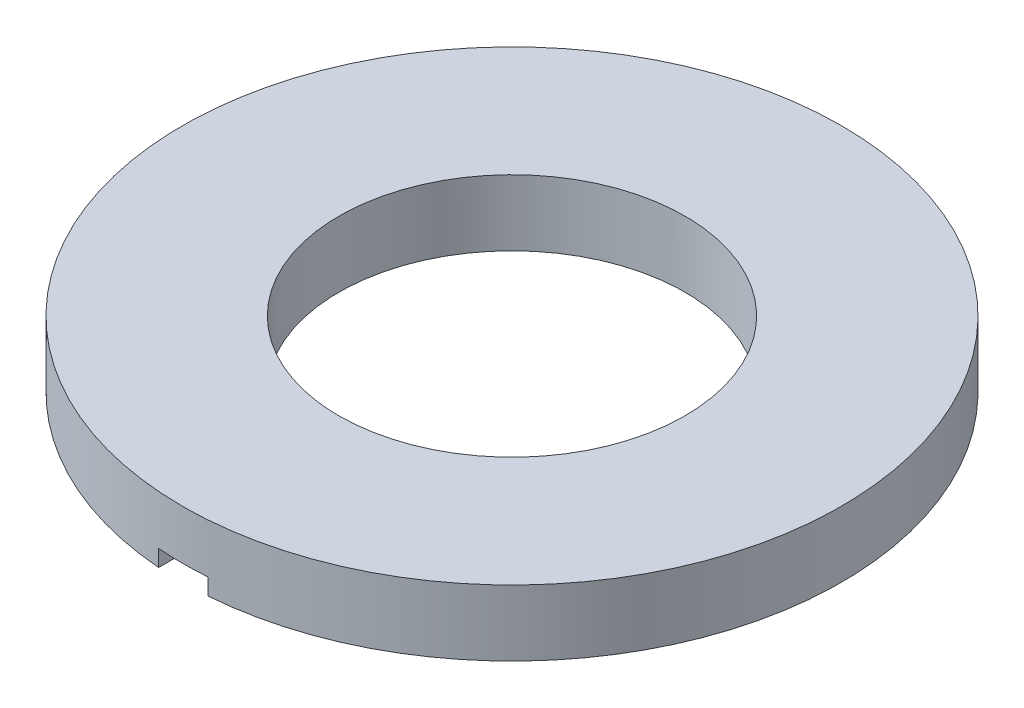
ISO-10303-21;
HEADER;
FILE_DESCRIPTION(('STEP AP214'),'2;1');
FILE_NAME('part.step','',(''),(''),'','','');
FILE_SCHEMA(('AUTOMOTIVE_DESIGN { 1 0 10303 214 1 1 1 1 }'));
ENDSEC;
DATA;
#1=APPLICATION_CONTEXT('core data for automotive mechanical design processes');
#2=APPLICATION_PROTOCOL_DEFINITION('international standard','automotive_design',2000,#1);
#3=PRODUCT_CONTEXT('',#1,'mechanical');
#4=PRODUCT('Part','Part','',(#3));
#5=PRODUCT_RELATED_PRODUCT_CATEGORY('part','',(#4));
#6=PRODUCT_DEFINITION_FORMATION('','',#4);
#7=PRODUCT_DEFINITION_CONTEXT('part definition',#1,'design');
#8=PRODUCT_DEFINITION('design','',#6,#7);
#9=PRODUCT_DEFINITION_SHAPE('','',#8);
#10=(LENGTH_UNIT() NAMED_UNIT(*) SI_UNIT(.MILLI.,.METRE.));
#11=(NAMED_UNIT(*) PLANE_ANGLE_UNIT() SI_UNIT($,.RADIAN.));
#12=(NAMED_UNIT(*) SI_UNIT($,.STERADIAN.) SOLID_ANGLE_UNIT());
#13=UNCERTAINTY_MEASURE_WITH_UNIT(LENGTH_MEASURE(1.E-05),#10,'distance_accuracy_value','');
#14=(GEOMETRIC_REPRESENTATION_CONTEXT(3) GLOBAL_UNCERTAINTY_ASSIGNED_CONTEXT((#13)) GLOBAL_UNIT_ASSIGNED_CONTEXT((#10,
#11,#12)) REPRESENTATION_CONTEXT('',''));
#15=CARTESIAN_POINT('',(0.,0.,0.));
#16=DIRECTION('',(0.,0.,1.));
#17=DIRECTION('',(1.,0.,0.));
#18=AXIS2_PLACEMENT_3D('',#15,#16,#17);
#19=CARTESIAN_POINT('',(0.,2.,0.));
#20=DIRECTION('',(0.,1.,0.));
#21=DIRECTION('',(0.,0.,1.));
#22=AXIS2_PLACEMENT_3D('',#19,#20,#21);
#23=PLANE('',#22);
#24=CARTESIAN_POINT('',(0.,2.,0.));
#25=DIRECTION('',(0.,1.,0.));
#26=DIRECTION('',(0.,0.,1.));
#27=AXIS2_PLACEMENT_3D('',#24,#25,#26);
#28=CIRCLE('',#27,10.);
#29=CARTESIAN_POINT('',(0.,2.,10.));
#30=VERTEX_POINT('',#29);
#31=EDGE_CURVE('E114',#30,#30,#28,.T.);
#32=ORIENTED_EDGE('',*,*,#31,.T.);
#33=EDGE_LOOP('',(#32));
#34=FACE_BOUND('',#33,.T.);
#35=CARTESIAN_POINT('',(0.,2.,0.));
#36=DIRECTION('',(0.,1.,0.));
#37=DIRECTION('',(0.,0.,1.));
#38=AXIS2_PLACEMENT_3D('',#35,#36,#37);
#39=CIRCLE('',#38,5.25);
#40=CARTESIAN_POINT('',(0.,2.,5.25));
#41=VERTEX_POINT('',#40);
#42=EDGE_CURVE('E102',#41,#41,#39,.T.);
#43=ORIENTED_EDGE('',*,*,#42,.F.);
#44=EDGE_LOOP('',(#43));
#45=FACE_BOUND('',#44,.T.);
#46=ADVANCED_FACE('F39',(#34,#45),#23,.T.);
#47=CARTESIAN_POINT('',(0.,0.,0.));
#48=DIRECTION('',(0.,1.,0.));
#49=DIRECTION('',(0.,0.,1.));
#50=AXIS2_PLACEMENT_3D('',#47,#48,#49);
#51=PLANE('',#50);
#52=CARTESIAN_POINT('',(0.,0.,0.));
#53=DIRECTION('',(0.,1.,0.));
#54=DIRECTION('',(0.,0.,1.));
#55=AXIS2_PLACEMENT_3D('',#52,#53,#54);
#56=CIRCLE('',#55,10.);
#57=CARTESIAN_POINT('',(0.75,0.,9.97183533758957));
#58=VERTEX_POINT('',#57);
#59=CARTESIAN_POINT('',(-0.75,0.,9.97183533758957));
#60=VERTEX_POINT('',#59);
#61=EDGE_CURVE('E94',#58,#60,#56,.T.);
#62=ORIENTED_EDGE('',*,*,#61,.F.);
#63=DIRECTION('',(0.,0.,1.));
#64=VECTOR('',#63,1.);
#65=CARTESIAN_POINT('',(0.75,0.,0.500000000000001));
#66=LINE('',#65,#64);
#67=CARTESIAN_POINT('',(0.75,0.,5.19615242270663));
#68=VERTEX_POINT('',#67);
#69=EDGE_CURVE('E81',#68,#58,#66,.T.);
#70=ORIENTED_EDGE('',*,*,#69,.F.);
#71=CARTESIAN_POINT('',(0.,0.,0.));
#72=DIRECTION('',(0.,1.,0.));
#73=DIRECTION('',(0.,0.,1.));
#74=AXIS2_PLACEMENT_3D('',#71,#72,#73);
#75=CIRCLE('',#74,5.25);
#76=CARTESIAN_POINT('',(-0.75,0.,5.19615242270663));
#77=VERTEX_POINT('',#76);
#78=EDGE_CURVE('E92',#68,#77,#75,.T.);
#79=ORIENTED_EDGE('',*,*,#78,.T.);
#80=DIRECTION('',(0.,0.,-1.));
#81=VECTOR('',#80,1.);
#82=CARTESIAN_POINT('',(-0.75,0.,0.500000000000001));
#83=LINE('',#82,#81);
#84=EDGE_CURVE('E96',#60,#77,#83,.T.);
#85=ORIENTED_EDGE('',*,*,#84,.F.);
#86=EDGE_LOOP('',(#62,#70,#79,#85));
#87=FACE_BOUND('',#86,.T.);
#88=ADVANCED_FACE('F90',(#87),#51,.F.);
#89=CARTESIAN_POINT('',(0.,2.,0.));
#90=DIRECTION('',(0.,-1.,0.));
#91=DIRECTION('',(0.,0.,-1.));
#92=AXIS2_PLACEMENT_3D('',#89,#90,#91);
#93=CYLINDRICAL_SURFACE('',#92,10.);
#94=ORIENTED_EDGE('',*,*,#31,.F.);
#95=EDGE_LOOP('',(#94));
#96=FACE_BOUND('',#95,.T.);
#97=CARTESIAN_POINT('',(0.,0.5,0.));
#98=DIRECTION('',(0.,1.,0.));
#99=DIRECTION('',(0.,0.,1.));
#100=AXIS2_PLACEMENT_3D('',#97,#98,#99);
#101=CIRCLE('',#100,10.);
#102=CARTESIAN_POINT('',(-0.75,0.5,9.97183533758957));
#103=VERTEX_POINT('',#102);
#104=CARTESIAN_POINT('',(0.75,0.5,9.97183533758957));
#105=VERTEX_POINT('',#104);
#106=EDGE_CURVE('E60',#103,#105,#101,.T.);
#107=ORIENTED_EDGE('',*,*,#106,.T.);
#108=DIRECTION('',(0.,-1.,0.));
#109=VECTOR('',#108,1.);
#110=CARTESIAN_POINT('',(0.75,2.,9.97183533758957));
#111=LINE('',#110,#109);
#112=EDGE_CURVE('E103',#105,#58,#111,.T.);
#113=ORIENTED_EDGE('',*,*,#112,.T.);
#114=ORIENTED_EDGE('',*,*,#61,.T.);
#115=DIRECTION('',(0.,-1.,0.));
#116=VECTOR('',#115,1.);
#117=CARTESIAN_POINT('',(-0.75,2.,9.97183533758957));
#118=LINE('',#117,#116);
#119=EDGE_CURVE('E111',#60,#103,#118,.F.);
#120=ORIENTED_EDGE('',*,*,#119,.T.);
#121=EDGE_LOOP('',(#107,#113,#114,#120));
#122=FACE_BOUND('',#121,.T.);
#123=ADVANCED_FACE('F41',(#96,#122),#93,.T.);
#124=CARTESIAN_POINT('',(0.,2.,0.));
#125=DIRECTION('',(0.,-1.,0.));
#126=DIRECTION('',(0.,0.,-1.));
#127=AXIS2_PLACEMENT_3D('',#124,#125,#126);
#128=CYLINDRICAL_SURFACE('',#127,5.25);
#129=DIRECTION('',(0.,-1.,0.));
#130=VECTOR('',#129,1.);
#131=CARTESIAN_POINT('',(0.75,2.,5.19615242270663));
#132=LINE('',#131,#130);
#133=CARTESIAN_POINT('',(0.75,0.5,5.19615242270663));
#134=VERTEX_POINT('',#133);
#135=EDGE_CURVE('E11',#134,#68,#132,.T.);
#136=ORIENTED_EDGE('',*,*,#135,.F.);
#137=CARTESIAN_POINT('',(0.,0.5,0.));
#138=DIRECTION('',(0.,1.,0.));
#139=DIRECTION('',(0.,0.,1.));
#140=AXIS2_PLACEMENT_3D('',#137,#138,#139);
#141=CIRCLE('',#140,5.25);
#142=CARTESIAN_POINT('',(-0.75,0.5,5.19615242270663));
#143=VERTEX_POINT('',#142);
#144=EDGE_CURVE('E118',#143,#134,#141,.T.);
#145=ORIENTED_EDGE('',*,*,#144,.F.);
#146=DIRECTION('',(0.,-1.,0.));
#147=VECTOR('',#146,1.);
#148=CARTESIAN_POINT('',(-0.75,2.,5.19615242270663));
#149=LINE('',#148,#147);
#150=EDGE_CURVE('E48',#77,#143,#149,.F.);
#151=ORIENTED_EDGE('',*,*,#150,.F.);
#152=ORIENTED_EDGE('',*,*,#78,.F.);
#153=EDGE_LOOP('',(#136,#145,#151,#152));
#154=FACE_BOUND('',#153,.T.);
#155=ORIENTED_EDGE('',*,*,#42,.T.);
#156=EDGE_LOOP('',(#155));
#157=FACE_BOUND('',#156,.T.);
#158=ADVANCED_FACE('F99',(#154,#157),#128,.F.);
#159=CARTESIAN_POINT('',(0.75,0.5,0.500000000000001));
#160=DIRECTION('',(1.,0.,0.));
#161=DIRECTION('',(0.,0.,-1.));
#162=AXIS2_PLACEMENT_3D('',#159,#160,#161);
#163=PLANE('',#162);
#164=DIRECTION('',(0.,0.,1.));
#165=VECTOR('',#164,1.);
#166=CARTESIAN_POINT('',(0.75,0.5,0.500000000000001));
#167=LINE('',#166,#165);
#168=EDGE_CURVE('E83',#134,#105,#167,.T.);
#169=ORIENTED_EDGE('',*,*,#168,.F.);
#170=ORIENTED_EDGE('',*,*,#135,.T.);
#171=ORIENTED_EDGE('',*,*,#69,.T.);
#172=ORIENTED_EDGE('',*,*,#112,.F.);
#173=EDGE_LOOP('',(#169,#170,#171,#172));
#174=FACE_BOUND('',#173,.T.);
#175=ADVANCED_FACE('F79',(#174),#163,.F.);
#176=CARTESIAN_POINT('',(-0.75,0.5,0.500000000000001));
#177=DIRECTION('',(-1.,0.,0.));
#178=DIRECTION('',(0.,0.,1.));
#179=AXIS2_PLACEMENT_3D('',#176,#177,#178);
#180=PLANE('',#179);
#181=ORIENTED_EDGE('',*,*,#84,.T.);
#182=ORIENTED_EDGE('',*,*,#150,.T.);
#183=DIRECTION('',(0.,0.,-1.));
#184=VECTOR('',#183,1.);
#185=CARTESIAN_POINT('',(-0.75,0.5,0.500000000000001));
#186=LINE('',#185,#184);
#187=EDGE_CURVE('E55',#103,#143,#186,.T.);
#188=ORIENTED_EDGE('',*,*,#187,.F.);
#189=ORIENTED_EDGE('',*,*,#119,.F.);
#190=EDGE_LOOP('',(#181,#182,#188,#189));
#191=FACE_BOUND('',#190,.T.);
#192=ADVANCED_FACE('F125',(#191),#180,.F.);
#193=CARTESIAN_POINT('',(0.,0.5,0.));
#194=DIRECTION('',(0.,1.,0.));
#195=DIRECTION('',(0.,0.,1.));
#196=AXIS2_PLACEMENT_3D('',#193,#194,#195);
#197=PLANE('',#196);
#198=ORIENTED_EDGE('',*,*,#106,.F.);
#199=ORIENTED_EDGE('',*,*,#187,.T.);
#200=ORIENTED_EDGE('',*,*,#144,.T.);
#201=ORIENTED_EDGE('',*,*,#168,.T.);
#202=EDGE_LOOP('',(#198,#199,#200,#201));
#203=FACE_BOUND('',#202,.T.);
#204=ADVANCED_FACE('F127',(#203),#197,.F.);
#205=CLOSED_SHELL('',(#46,#88,#123,#158,#175,#192,#204));
#206=MANIFOLD_SOLID_BREP('B2',#205);
#207=ADVANCED_BREP_SHAPE_REPRESENTATION('',(#18,#206),#14);
#208=SHAPE_DEFINITION_REPRESENTATION(#9,#207);
ENDSEC;
END-ISO-10303-21;
